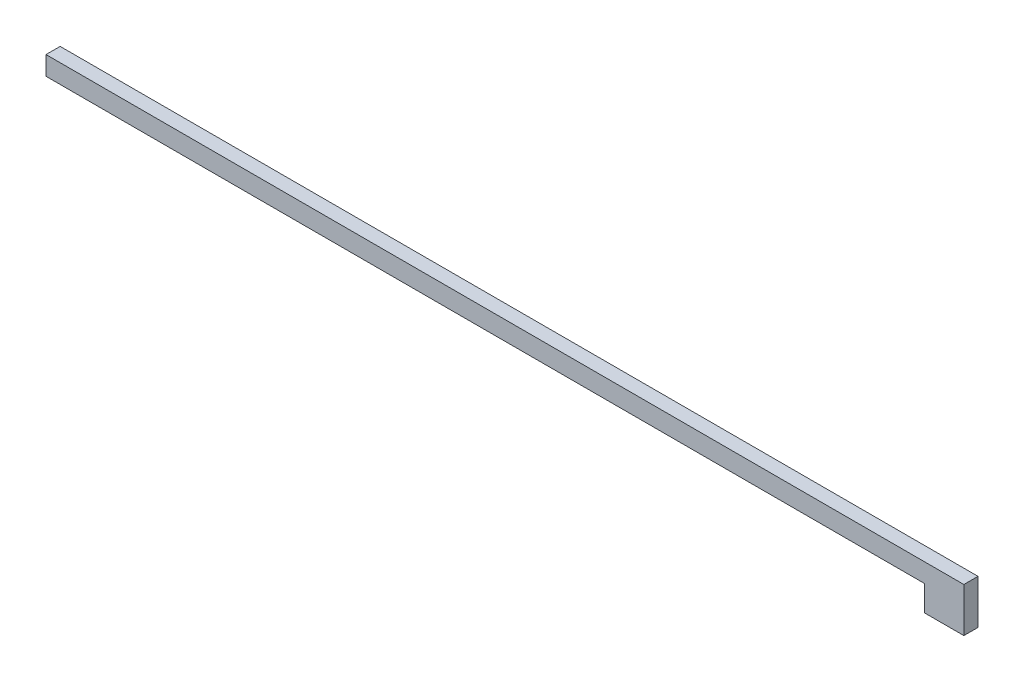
ISO-10303-21;
HEADER;
FILE_DESCRIPTION(('STEP AP214'),'2;1');
FILE_NAME('part.step','',(''),(''),'','','');
FILE_SCHEMA(('AUTOMOTIVE_DESIGN { 1 0 10303 214 1 1 1 1 }'));
ENDSEC;
DATA;
#1=APPLICATION_CONTEXT('core data for automotive mechanical design processes');
#2=APPLICATION_PROTOCOL_DEFINITION('international standard','automotive_design',2000,#1);
#3=PRODUCT_CONTEXT('',#1,'mechanical');
#4=PRODUCT('Part','Part','',(#3));
#5=PRODUCT_RELATED_PRODUCT_CATEGORY('part','',(#4));
#6=PRODUCT_DEFINITION_FORMATION('','',#4);
#7=PRODUCT_DEFINITION_CONTEXT('part definition',#1,'design');
#8=PRODUCT_DEFINITION('design','',#6,#7);
#9=PRODUCT_DEFINITION_SHAPE('','',#8);
#10=(LENGTH_UNIT() NAMED_UNIT(*) SI_UNIT(.MILLI.,.METRE.));
#11=(NAMED_UNIT(*) PLANE_ANGLE_UNIT() SI_UNIT($,.RADIAN.));
#12=(NAMED_UNIT(*) SI_UNIT($,.STERADIAN.) SOLID_ANGLE_UNIT());
#13=UNCERTAINTY_MEASURE_WITH_UNIT(LENGTH_MEASURE(1.E-05),#10,'distance_accuracy_value','');
#14=(GEOMETRIC_REPRESENTATION_CONTEXT(3) GLOBAL_UNCERTAINTY_ASSIGNED_CONTEXT((#13)) GLOBAL_UNIT_ASSIGNED_CONTEXT((#10,
#11,#12)) REPRESENTATION_CONTEXT('',''));
#15=CARTESIAN_POINT('',(0.,0.,0.));
#16=DIRECTION('',(0.,0.,1.));
#17=DIRECTION('',(1.,0.,0.));
#18=AXIS2_PLACEMENT_3D('',#15,#16,#17);
#19=CARTESIAN_POINT('',(-122.621316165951,24.3843633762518,3.81));
#20=DIRECTION('',(1.,0.,0.));
#21=DIRECTION('',(0.,0.,-1.));
#22=AXIS2_PLACEMENT_3D('',#19,#20,#21);
#23=PLANE('',#22);
#24=DIRECTION('',(0.,-1.,0.));
#25=VECTOR('',#24,1.);
#26=CARTESIAN_POINT('',(-122.621316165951,24.3843633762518,0.));
#27=LINE('',#26,#25);
#28=CARTESIAN_POINT('',(-122.621316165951,24.3843633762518,0.));
#29=VERTEX_POINT('',#28);
#30=CARTESIAN_POINT('',(-122.621316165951,19.3043633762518,0.));
#31=VERTEX_POINT('',#30);
#32=EDGE_CURVE('E87',#29,#31,#27,.T.);
#33=ORIENTED_EDGE('',*,*,#32,.T.);
#34=DIRECTION('',(0.,0.,-1.));
#35=VECTOR('',#34,1.);
#36=CARTESIAN_POINT('',(-122.621316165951,19.3043633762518,3.81));
#37=LINE('',#36,#35);
#38=CARTESIAN_POINT('',(-122.621316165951,19.3043633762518,3.81));
#39=VERTEX_POINT('',#38);
#40=EDGE_CURVE('E11',#39,#31,#37,.T.);
#41=ORIENTED_EDGE('',*,*,#40,.F.);
#42=DIRECTION('',(0.,-1.,0.));
#43=VECTOR('',#42,1.);
#44=CARTESIAN_POINT('',(-122.621316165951,24.3843633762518,3.81));
#45=LINE('',#44,#43);
#46=CARTESIAN_POINT('',(-122.621316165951,24.3843633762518,3.81));
#47=VERTEX_POINT('',#46);
#48=EDGE_CURVE('E111',#47,#39,#45,.T.);
#49=ORIENTED_EDGE('',*,*,#48,.F.);
#50=DIRECTION('',(0.,0.,-1.));
#51=VECTOR('',#50,1.);
#52=CARTESIAN_POINT('',(-122.621316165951,24.3843633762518,3.81));
#53=LINE('',#52,#51);
#54=EDGE_CURVE('E100',#47,#29,#53,.T.);
#55=ORIENTED_EDGE('',*,*,#54,.T.);
#56=EDGE_LOOP('',(#33,#41,#49,#55));
#57=FACE_BOUND('',#56,.T.);
#58=ADVANCED_FACE('F31',(#57),#23,.F.);
#59=CARTESIAN_POINT('',(-122.621316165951,19.3043633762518,3.81));
#60=DIRECTION('',(0.,1.,0.));
#61=DIRECTION('',(0.,0.,1.));
#62=AXIS2_PLACEMENT_3D('',#59,#60,#61);
#63=PLANE('',#62);
#64=DIRECTION('',(1.,0.,0.));
#65=VECTOR('',#64,1.);
#66=CARTESIAN_POINT('',(-122.621316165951,19.3043633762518,0.));
#67=LINE('',#66,#65);
#68=CARTESIAN_POINT('',(114.106683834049,19.3043633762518,0.));
#69=VERTEX_POINT('',#68);
#70=EDGE_CURVE('E83',#31,#69,#67,.T.);
#71=ORIENTED_EDGE('',*,*,#70,.T.);
#72=DIRECTION('',(0.,0.,-1.));
#73=VECTOR('',#72,1.);
#74=CARTESIAN_POINT('',(114.106683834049,19.3043633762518,3.81));
#75=LINE('',#74,#73);
#76=CARTESIAN_POINT('',(114.106683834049,19.3043633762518,3.81));
#77=VERTEX_POINT('',#76);
#78=EDGE_CURVE('E38',#77,#69,#75,.T.);
#79=ORIENTED_EDGE('',*,*,#78,.F.);
#80=DIRECTION('',(1.,0.,0.));
#81=VECTOR('',#80,1.);
#82=CARTESIAN_POINT('',(-122.621316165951,19.3043633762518,3.81));
#83=LINE('',#82,#81);
#84=EDGE_CURVE('E96',#39,#77,#83,.T.);
#85=ORIENTED_EDGE('',*,*,#84,.F.);
#86=ORIENTED_EDGE('',*,*,#40,.T.);
#87=EDGE_LOOP('',(#71,#79,#85,#86));
#88=FACE_BOUND('',#87,.T.);
#89=ADVANCED_FACE('F95',(#88),#63,.F.);
#90=CARTESIAN_POINT('',(114.106683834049,19.3043633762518,3.81));
#91=DIRECTION('',(1.,0.,0.));
#92=DIRECTION('',(0.,0.,-1.));
#93=AXIS2_PLACEMENT_3D('',#90,#91,#92);
#94=PLANE('',#93);
#95=DIRECTION('',(0.,-1.,0.));
#96=VECTOR('',#95,1.);
#97=CARTESIAN_POINT('',(114.106683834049,19.3043633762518,0.));
#98=LINE('',#97,#96);
#99=CARTESIAN_POINT('',(114.106683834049,12.4463633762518,0.));
#100=VERTEX_POINT('',#99);
#101=EDGE_CURVE('E89',#69,#100,#98,.T.);
#102=ORIENTED_EDGE('',*,*,#101,.T.);
#103=DIRECTION('',(0.,0.,-1.));
#104=VECTOR('',#103,1.);
#105=CARTESIAN_POINT('',(114.106683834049,12.4463633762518,3.81));
#106=LINE('',#105,#104);
#107=CARTESIAN_POINT('',(114.106683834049,12.4463633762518,3.81));
#108=VERTEX_POINT('',#107);
#109=EDGE_CURVE('E127',#108,#100,#106,.T.);
#110=ORIENTED_EDGE('',*,*,#109,.F.);
#111=DIRECTION('',(0.,-1.,0.));
#112=VECTOR('',#111,1.);
#113=CARTESIAN_POINT('',(114.106683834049,19.3043633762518,3.81));
#114=LINE('',#113,#112);
#115=EDGE_CURVE('E114',#77,#108,#114,.T.);
#116=ORIENTED_EDGE('',*,*,#115,.F.);
#117=ORIENTED_EDGE('',*,*,#78,.T.);
#118=EDGE_LOOP('',(#102,#110,#116,#117));
#119=FACE_BOUND('',#118,.T.);
#120=ADVANCED_FACE('F131',(#119),#94,.F.);
#121=CARTESIAN_POINT('',(114.106683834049,12.4463633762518,3.81));
#122=DIRECTION('',(0.,1.,0.));
#123=DIRECTION('',(0.,0.,1.));
#124=AXIS2_PLACEMENT_3D('',#121,#122,#123);
#125=PLANE('',#124);
#126=DIRECTION('',(1.,0.,0.));
#127=VECTOR('',#126,1.);
#128=CARTESIAN_POINT('',(114.106683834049,12.4463633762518,0.));
#129=LINE('',#128,#127);
#130=CARTESIAN_POINT('',(124.774683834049,12.4463633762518,0.));
#131=VERTEX_POINT('',#130);
#132=EDGE_CURVE('E104',#100,#131,#129,.T.);
#133=ORIENTED_EDGE('',*,*,#132,.T.);
#134=DIRECTION('',(0.,0.,-1.));
#135=VECTOR('',#134,1.);
#136=CARTESIAN_POINT('',(124.774683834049,12.4463633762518,3.81));
#137=LINE('',#136,#135);
#138=CARTESIAN_POINT('',(124.774683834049,12.4463633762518,3.81));
#139=VERTEX_POINT('',#138);
#140=EDGE_CURVE('E124',#139,#131,#137,.T.);
#141=ORIENTED_EDGE('',*,*,#140,.F.);
#142=DIRECTION('',(1.,0.,0.));
#143=VECTOR('',#142,1.);
#144=CARTESIAN_POINT('',(114.106683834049,12.4463633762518,3.81));
#145=LINE('',#144,#143);
#146=EDGE_CURVE('E116',#108,#139,#145,.T.);
#147=ORIENTED_EDGE('',*,*,#146,.F.);
#148=ORIENTED_EDGE('',*,*,#109,.T.);
#149=EDGE_LOOP('',(#133,#141,#147,#148));
#150=FACE_BOUND('',#149,.T.);
#151=ADVANCED_FACE('F137',(#150),#125,.F.);
#152=CARTESIAN_POINT('',(124.774683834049,24.3843633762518,3.81));
#153=DIRECTION('',(-1.,0.,0.));
#154=DIRECTION('',(0.,0.,1.));
#155=AXIS2_PLACEMENT_3D('',#152,#153,#154);
#156=PLANE('',#155);
#157=DIRECTION('',(0.,1.,0.));
#158=VECTOR('',#157,1.);
#159=CARTESIAN_POINT('',(124.774683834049,24.3843633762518,0.));
#160=LINE('',#159,#158);
#161=CARTESIAN_POINT('',(124.774683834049,24.3843633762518,0.));
#162=VERTEX_POINT('',#161);
#163=EDGE_CURVE('E107',#131,#162,#160,.T.);
#164=ORIENTED_EDGE('',*,*,#163,.T.);
#165=DIRECTION('',(0.,0.,-1.));
#166=VECTOR('',#165,1.);
#167=CARTESIAN_POINT('',(124.774683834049,24.3843633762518,3.81));
#168=LINE('',#167,#166);
#169=CARTESIAN_POINT('',(124.774683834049,24.3843633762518,3.81));
#170=VERTEX_POINT('',#169);
#171=EDGE_CURVE('E121',#170,#162,#168,.T.);
#172=ORIENTED_EDGE('',*,*,#171,.F.);
#173=DIRECTION('',(0.,1.,0.));
#174=VECTOR('',#173,1.);
#175=CARTESIAN_POINT('',(124.774683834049,12.4463633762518,3.81));
#176=LINE('',#175,#174);
#177=EDGE_CURVE('E50',#139,#170,#176,.T.);
#178=ORIENTED_EDGE('',*,*,#177,.F.);
#179=ORIENTED_EDGE('',*,*,#140,.T.);
#180=EDGE_LOOP('',(#164,#172,#178,#179));
#181=FACE_BOUND('',#180,.T.);
#182=ADVANCED_FACE('F139',(#181),#156,.F.);
#183=CARTESIAN_POINT('',(-122.621316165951,24.3843633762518,3.81));
#184=DIRECTION('',(0.,-1.,0.));
#185=DIRECTION('',(0.,0.,-1.));
#186=AXIS2_PLACEMENT_3D('',#183,#184,#185);
#187=PLANE('',#186);
#188=DIRECTION('',(-1.,0.,0.));
#189=VECTOR('',#188,1.);
#190=CARTESIAN_POINT('',(-122.621316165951,24.3843633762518,0.));
#191=LINE('',#190,#189);
#192=EDGE_CURVE('E109',#162,#29,#191,.T.);
#193=ORIENTED_EDGE('',*,*,#192,.T.);
#194=ORIENTED_EDGE('',*,*,#54,.F.);
#195=DIRECTION('',(-1.,0.,0.));
#196=VECTOR('',#195,1.);
#197=CARTESIAN_POINT('',(-122.621316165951,24.3843633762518,3.81));
#198=LINE('',#197,#196);
#199=EDGE_CURVE('E45',#170,#47,#198,.T.);
#200=ORIENTED_EDGE('',*,*,#199,.F.);
#201=ORIENTED_EDGE('',*,*,#171,.T.);
#202=EDGE_LOOP('',(#193,#194,#200,#201));
#203=FACE_BOUND('',#202,.T.);
#204=ADVANCED_FACE('F141',(#203),#187,.F.);
#205=CARTESIAN_POINT('',(-122.621316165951,19.3043633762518,3.81));
#206=DIRECTION('',(0.,0.,1.));
#207=DIRECTION('',(1.,0.,0.));
#208=AXIS2_PLACEMENT_3D('',#205,#206,#207);
#209=PLANE('',#208);
#210=ORIENTED_EDGE('',*,*,#48,.T.);
#211=ORIENTED_EDGE('',*,*,#84,.T.);
#212=ORIENTED_EDGE('',*,*,#115,.T.);
#213=ORIENTED_EDGE('',*,*,#146,.T.);
#214=ORIENTED_EDGE('',*,*,#177,.T.);
#215=ORIENTED_EDGE('',*,*,#199,.T.);
#216=EDGE_LOOP('',(#210,#211,#212,#213,#214,#215));
#217=FACE_BOUND('',#216,.T.);
#218=ADVANCED_FACE('F134',(#217),#209,.T.);
#219=CARTESIAN_POINT('',(-122.621316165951,19.3043633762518,0.));
#220=DIRECTION('',(0.,0.,1.));
#221=DIRECTION('',(1.,0.,0.));
#222=AXIS2_PLACEMENT_3D('',#219,#220,#221);
#223=PLANE('',#222);
#224=ORIENTED_EDGE('',*,*,#32,.F.);
#225=ORIENTED_EDGE('',*,*,#192,.F.);
#226=ORIENTED_EDGE('',*,*,#163,.F.);
#227=ORIENTED_EDGE('',*,*,#132,.F.);
#228=ORIENTED_EDGE('',*,*,#101,.F.);
#229=ORIENTED_EDGE('',*,*,#70,.F.);
#230=EDGE_LOOP('',(#224,#225,#226,#227,#228,#229));
#231=FACE_BOUND('',#230,.T.);
#232=ADVANCED_FACE('F84',(#231),#223,.F.);
#233=CLOSED_SHELL('',(#58,#89,#120,#151,#182,#204,#218,#232));
#234=MANIFOLD_SOLID_BREP('B2',#233);
#235=ADVANCED_BREP_SHAPE_REPRESENTATION('',(#18,#234),#14);
#236=SHAPE_DEFINITION_REPRESENTATION(#9,#235);
ENDSEC;
END-ISO-10303-21;
